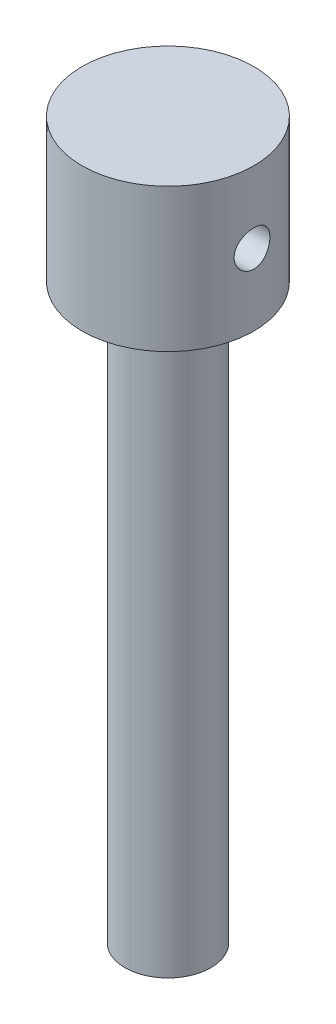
from build123d import *

# Parameters (mm, degrees)
SKETCH1_R               = 6
BOSS_EXTRUDE1_DEPTH     = 80
SKETCH2_R               = 12
BOSS_EXTRUDE2_DEPTH     = 20
CUT_EXTRUDE1_DEPTH      = 102.429778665
CUT_EXTRUDE1_DEPTH_BACK = 102.429778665
SKETCH3_R               = 2.5


with BuildPart() as part:
    # Sketch1 → Boss-Extrude1 (new body)
    with BuildSketch(Plane(origin=(0, 0, 0), x_dir=(1, 0, 0), z_dir=(0, 1, 0))):
        with Locations(Location((0, 0, 0), (0, 0, 270))):
            Circle(SKETCH1_R)
    extrude(amount=BOSS_EXTRUDE1_DEPTH)

    # Sketch2 → Boss-Extrude2 (add)
    with BuildSketch(Plane(origin=(0, 80, 0), x_dir=(1, 0, 0), z_dir=(0, 1, 0))):
        with Locations(Location((0, 0, 0), (0, 0, 270))):
            Circle(SKETCH2_R)
    extrude(amount=BOSS_EXTRUDE2_DEPTH)

    # Sketch3 → Cut-Extrude1 (cut, two sides: drawn at the far end of the back side and taken through both)
    with BuildSketch(Plane(origin=(0, 0, 0), x_dir=(0, 0, -1), z_dir=(1, 0, 0)).offset(-CUT_EXTRUDE1_DEPTH_BACK)):
        with Locations((0, 90)):
            Circle(SKETCH3_R)
    extrude(amount=CUT_EXTRUDE1_DEPTH + CUT_EXTRUDE1_DEPTH_BACK, mode=Mode.SUBTRACT)


solid = part.part
